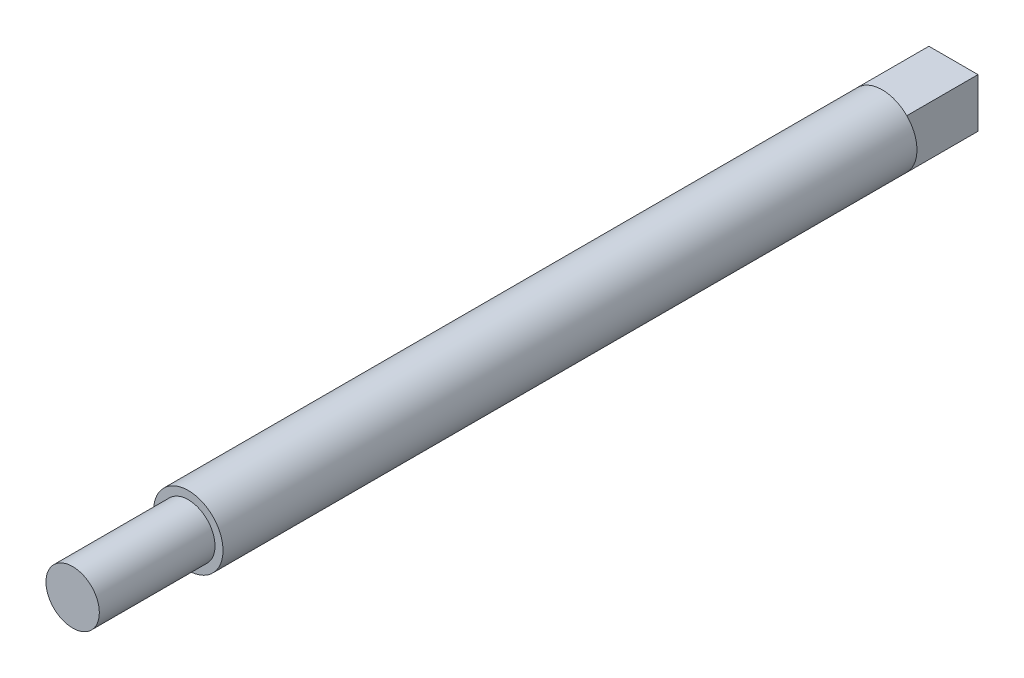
ISO-10303-21;
HEADER;
FILE_DESCRIPTION(('STEP AP214'),'2;1');
FILE_NAME('part.step','',(''),(''),'','','');
FILE_SCHEMA(('AUTOMOTIVE_DESIGN { 1 0 10303 214 1 1 1 1 }'));
ENDSEC;
DATA;
#1=APPLICATION_CONTEXT('core data for automotive mechanical design processes');
#2=APPLICATION_PROTOCOL_DEFINITION('international standard','automotive_design',2000,#1);
#3=PRODUCT_CONTEXT('',#1,'mechanical');
#4=PRODUCT('Part','Part','',(#3));
#5=PRODUCT_RELATED_PRODUCT_CATEGORY('part','',(#4));
#6=PRODUCT_DEFINITION_FORMATION('','',#4);
#7=PRODUCT_DEFINITION_CONTEXT('part definition',#1,'design');
#8=PRODUCT_DEFINITION('design','',#6,#7);
#9=PRODUCT_DEFINITION_SHAPE('','',#8);
#10=(LENGTH_UNIT() NAMED_UNIT(*) SI_UNIT(.MILLI.,.METRE.));
#11=(NAMED_UNIT(*) PLANE_ANGLE_UNIT() SI_UNIT($,.RADIAN.));
#12=(NAMED_UNIT(*) SI_UNIT($,.STERADIAN.) SOLID_ANGLE_UNIT());
#13=UNCERTAINTY_MEASURE_WITH_UNIT(LENGTH_MEASURE(1.E-05),#10,'distance_accuracy_value','');
#14=(GEOMETRIC_REPRESENTATION_CONTEXT(3) GLOBAL_UNCERTAINTY_ASSIGNED_CONTEXT((#13)) GLOBAL_UNIT_ASSIGNED_CONTEXT((#10,
#11,#12)) REPRESENTATION_CONTEXT('',''));
#15=CARTESIAN_POINT('',(0.,0.,0.));
#16=DIRECTION('',(0.,0.,1.));
#17=DIRECTION('',(1.,0.,0.));
#18=AXIS2_PLACEMENT_3D('',#15,#16,#17);
#19=CARTESIAN_POINT('',(0.,0.,0.));
#20=DIRECTION('',(0.,0.,1.));
#21=DIRECTION('',(1.,0.,0.));
#22=AXIS2_PLACEMENT_3D('',#19,#20,#21);
#23=PLANE('',#22);
#24=DIRECTION('',(0.,1.,0.));
#25=VECTOR('',#24,1.);
#26=CARTESIAN_POINT('',(-1.38,1.38,0.));
#27=LINE('',#26,#25);
#28=CARTESIAN_POINT('',(-1.38,-1.3777155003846,0.));
#29=VERTEX_POINT('',#28);
#30=CARTESIAN_POINT('',(-1.38,1.3777155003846,0.));
#31=VERTEX_POINT('',#30);
#32=EDGE_CURVE('E12',#29,#31,#27,.T.);
#33=ORIENTED_EDGE('',*,*,#32,.F.);
#34=CARTESIAN_POINT('',(0.,0.,0.));
#35=DIRECTION('',(0.,0.,1.));
#36=DIRECTION('',(1.,0.,0.));
#37=AXIS2_PLACEMENT_3D('',#34,#35,#36);
#38=CIRCLE('',#37,1.95);
#39=EDGE_CURVE('E370',#31,#29,#38,.T.);
#40=ORIENTED_EDGE('',*,*,#39,.F.);
#41=EDGE_LOOP('',(#33,#40));
#42=FACE_BOUND('',#41,.T.);
#43=ADVANCED_FACE('F40',(#42),#23,.F.);
#44=DIRECTION('',(-1.,0.,0.));
#45=VECTOR('',#44,1.);
#46=CARTESIAN_POINT('',(1.38,-1.38,0.));
#47=LINE('',#46,#45);
#48=CARTESIAN_POINT('',(1.3777155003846,-1.38,0.));
#49=VERTEX_POINT('',#48);
#50=CARTESIAN_POINT('',(-1.3777155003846,-1.38,0.));
#51=VERTEX_POINT('',#50);
#52=EDGE_CURVE('E49',#49,#51,#47,.T.);
#53=ORIENTED_EDGE('',*,*,#52,.F.);
#54=EDGE_CURVE('E158',#51,#49,#38,.T.);
#55=ORIENTED_EDGE('',*,*,#54,.F.);
#56=EDGE_LOOP('',(#53,#55));
#57=FACE_BOUND('',#56,.T.);
#58=ADVANCED_FACE('F176',(#57),#23,.F.);
#59=DIRECTION('',(0.,-1.,0.));
#60=VECTOR('',#59,1.);
#61=CARTESIAN_POINT('',(1.38,1.38,0.));
#62=LINE('',#61,#60);
#63=CARTESIAN_POINT('',(1.38,1.3777155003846,0.));
#64=VERTEX_POINT('',#63);
#65=CARTESIAN_POINT('',(1.38,-1.3777155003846,0.));
#66=VERTEX_POINT('',#65);
#67=EDGE_CURVE('E152',#64,#66,#62,.T.);
#68=ORIENTED_EDGE('',*,*,#67,.F.);
#69=EDGE_CURVE('E58',#66,#64,#38,.T.);
#70=ORIENTED_EDGE('',*,*,#69,.F.);
#71=EDGE_LOOP('',(#68,#70));
#72=FACE_BOUND('',#71,.T.);
#73=ADVANCED_FACE('F173',(#72),#23,.F.);
#74=DIRECTION('',(1.,0.,0.));
#75=VECTOR('',#74,1.);
#76=CARTESIAN_POINT('',(1.38,1.38,0.));
#77=LINE('',#76,#75);
#78=CARTESIAN_POINT('',(-1.3777155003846,1.38,0.));
#79=VERTEX_POINT('',#78);
#80=CARTESIAN_POINT('',(1.3777155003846,1.38,0.));
#81=VERTEX_POINT('',#80);
#82=EDGE_CURVE('E145',#79,#81,#77,.T.);
#83=ORIENTED_EDGE('',*,*,#82,.F.);
#84=EDGE_CURVE('E146',#81,#79,#38,.T.);
#85=ORIENTED_EDGE('',*,*,#84,.F.);
#86=EDGE_LOOP('',(#83,#85));
#87=FACE_BOUND('',#86,.T.);
#88=ADVANCED_FACE('F165',(#87),#23,.F.);
#89=CARTESIAN_POINT('',(0.,0.,45.5));
#90=DIRECTION('',(0.,0.,-1.));
#91=DIRECTION('',(-1.,0.,0.));
#92=AXIS2_PLACEMENT_3D('',#89,#90,#91);
#93=CYLINDRICAL_SURFACE('',#92,1.95);
#94=EDGE_CURVE('E144',#64,#81,#38,.T.);
#95=ORIENTED_EDGE('',*,*,#94,.T.);
#96=ORIENTED_EDGE('',*,*,#84,.T.);
#97=EDGE_CURVE('E156',#79,#31,#38,.T.);
#98=ORIENTED_EDGE('',*,*,#97,.T.);
#99=ORIENTED_EDGE('',*,*,#39,.T.);
#100=EDGE_CURVE('E369',#29,#51,#38,.T.);
#101=ORIENTED_EDGE('',*,*,#100,.T.);
#102=ORIENTED_EDGE('',*,*,#54,.T.);
#103=EDGE_CURVE('E157',#49,#66,#38,.T.);
#104=ORIENTED_EDGE('',*,*,#103,.T.);
#105=ORIENTED_EDGE('',*,*,#69,.T.);
#106=EDGE_LOOP('',(#95,#96,#98,#99,#101,#102,#104,#105));
#107=FACE_BOUND('',#106,.T.);
#108=CARTESIAN_POINT('',(0.,0.,39.));
#109=DIRECTION('',(0.,0.,1.));
#110=DIRECTION('',(1.,0.,0.));
#111=AXIS2_PLACEMENT_3D('',#108,#109,#110);
#112=CIRCLE('',#111,1.95);
#113=CARTESIAN_POINT('',(1.95,0.,39.));
#114=VERTEX_POINT('',#113);
#115=EDGE_CURVE('E44',#114,#114,#112,.T.);
#116=ORIENTED_EDGE('',*,*,#115,.F.);
#117=EDGE_LOOP('',(#116));
#118=FACE_BOUND('',#117,.T.);
#119=ADVANCED_FACE('F42',(#107,#118),#93,.T.);
#120=CARTESIAN_POINT('',(0.,0.,39.));
#121=DIRECTION('',(0.,0.,1.));
#122=DIRECTION('',(1.,0.,0.));
#123=AXIS2_PLACEMENT_3D('',#120,#121,#122);
#124=PLANE('',#123);
#125=CARTESIAN_POINT('',(0.,0.,39.));
#126=DIRECTION('',(0.,0.,1.));
#127=DIRECTION('',(1.,0.,0.));
#128=AXIS2_PLACEMENT_3D('',#125,#126,#127);
#129=CIRCLE('',#128,1.5);
#130=CARTESIAN_POINT('',(1.5,0.,39.));
#131=VERTEX_POINT('',#130);
#132=EDGE_CURVE('E137',#131,#131,#129,.T.);
#133=ORIENTED_EDGE('',*,*,#132,.F.);
#134=EDGE_LOOP('',(#133));
#135=FACE_BOUND('',#134,.T.);
#136=ORIENTED_EDGE('',*,*,#115,.T.);
#137=EDGE_LOOP('',(#136));
#138=FACE_BOUND('',#137,.T.);
#139=ADVANCED_FACE('F162',(#135,#138),#124,.T.);
#140=CARTESIAN_POINT('',(0.,0.,39.));
#141=DIRECTION('',(0.,0.,1.));
#142=DIRECTION('',(1.,0.,0.));
#143=AXIS2_PLACEMENT_3D('',#140,#141,#142);
#144=CYLINDRICAL_SURFACE('',#143,1.5);
#145=CARTESIAN_POINT('',(0.,0.,45.5));
#146=DIRECTION('',(0.,0.,1.));
#147=DIRECTION('',(1.,0.,0.));
#148=AXIS2_PLACEMENT_3D('',#145,#146,#147);
#149=CIRCLE('',#148,1.5);
#150=CARTESIAN_POINT('',(1.5,0.,45.5));
#151=VERTEX_POINT('',#150);
#152=EDGE_CURVE('E134',#151,#151,#149,.T.);
#153=CARTESIAN_POINT('',(1.5,0.,39.));
#154=CARTESIAN_POINT('',(1.5,0.,39.0677083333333));
#155=CARTESIAN_POINT('',(1.5,0.,39.1354166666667));
#156=CARTESIAN_POINT('',(1.5,0.,39.2708333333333));
#157=CARTESIAN_POINT('',(1.5,0.,39.3385416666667));
#158=CARTESIAN_POINT('',(1.5,0.,39.4739583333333));
#159=CARTESIAN_POINT('',(1.5,0.,39.5416666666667));
#160=CARTESIAN_POINT('',(1.5,0.,39.6770833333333));
#161=CARTESIAN_POINT('',(1.5,0.,39.7447916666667));
#162=CARTESIAN_POINT('',(1.5,0.,39.8802083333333));
#163=CARTESIAN_POINT('',(1.5,0.,39.9479166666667));
#164=CARTESIAN_POINT('',(1.5,0.,40.0833333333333));
#165=CARTESIAN_POINT('',(1.5,0.,40.1510416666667));
#166=CARTESIAN_POINT('',(1.5,0.,40.2864583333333));
#167=CARTESIAN_POINT('',(1.5,0.,40.3541666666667));
#168=CARTESIAN_POINT('',(1.5,0.,40.4895833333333));
#169=CARTESIAN_POINT('',(1.5,0.,40.5572916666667));
#170=CARTESIAN_POINT('',(1.5,0.,40.6927083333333));
#171=CARTESIAN_POINT('',(1.5,0.,40.7604166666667));
#172=CARTESIAN_POINT('',(1.5,0.,40.8958333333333));
#173=CARTESIAN_POINT('',(1.5,0.,40.9635416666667));
#174=CARTESIAN_POINT('',(1.5,0.,41.0989583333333));
#175=CARTESIAN_POINT('',(1.5,0.,41.1666666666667));
#176=CARTESIAN_POINT('',(1.5,0.,41.3020833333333));
#177=CARTESIAN_POINT('',(1.5,0.,41.3697916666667));
#178=CARTESIAN_POINT('',(1.5,0.,41.5052083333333));
#179=CARTESIAN_POINT('',(1.5,0.,41.5729166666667));
#180=CARTESIAN_POINT('',(1.5,0.,41.7083333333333));
#181=CARTESIAN_POINT('',(1.5,0.,41.7760416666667));
#182=CARTESIAN_POINT('',(1.5,0.,41.9114583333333));
#183=CARTESIAN_POINT('',(1.5,0.,41.9791666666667));
#184=CARTESIAN_POINT('',(1.5,0.,42.1145833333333));
#185=CARTESIAN_POINT('',(1.5,0.,42.1822916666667));
#186=CARTESIAN_POINT('',(1.5,0.,42.3177083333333));
#187=CARTESIAN_POINT('',(1.5,0.,42.3854166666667));
#188=CARTESIAN_POINT('',(1.5,0.,42.5208333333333));
#189=CARTESIAN_POINT('',(1.5,0.,42.5885416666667));
#190=CARTESIAN_POINT('',(1.5,0.,42.7239583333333));
#191=CARTESIAN_POINT('',(1.5,0.,42.7916666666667));
#192=CARTESIAN_POINT('',(1.5,0.,42.9270833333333));
#193=CARTESIAN_POINT('',(1.5,0.,42.9947916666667));
#194=CARTESIAN_POINT('',(1.5,0.,43.1302083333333));
#195=CARTESIAN_POINT('',(1.5,0.,43.1979166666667));
#196=CARTESIAN_POINT('',(1.5,0.,43.3333333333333));
#197=CARTESIAN_POINT('',(1.5,0.,43.4010416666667));
#198=CARTESIAN_POINT('',(1.5,0.,43.5364583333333));
#199=CARTESIAN_POINT('',(1.5,0.,43.6041666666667));
#200=CARTESIAN_POINT('',(1.5,0.,43.7395833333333));
#201=CARTESIAN_POINT('',(1.5,0.,43.8072916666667));
#202=CARTESIAN_POINT('',(1.5,0.,43.9427083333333));
#203=CARTESIAN_POINT('',(1.5,0.,44.0104166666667));
#204=CARTESIAN_POINT('',(1.5,0.,44.1458333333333));
#205=CARTESIAN_POINT('',(1.5,0.,44.2135416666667));
#206=CARTESIAN_POINT('',(1.5,0.,44.3489583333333));
#207=CARTESIAN_POINT('',(1.5,0.,44.4166666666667));
#208=CARTESIAN_POINT('',(1.5,0.,44.5520833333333));
#209=CARTESIAN_POINT('',(1.5,0.,44.6197916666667));
#210=CARTESIAN_POINT('',(1.5,0.,44.7552083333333));
#211=CARTESIAN_POINT('',(1.5,0.,44.8229166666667));
#212=CARTESIAN_POINT('',(1.5,0.,44.9583333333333));
#213=CARTESIAN_POINT('',(1.5,0.,45.0260416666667));
#214=CARTESIAN_POINT('',(1.5,0.,45.1614583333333));
#215=CARTESIAN_POINT('',(1.5,0.,45.2291666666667));
#216=CARTESIAN_POINT('',(1.5,0.,45.3645833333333));
#217=CARTESIAN_POINT('',(1.5,0.,45.4322916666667));
#218=CARTESIAN_POINT('',(1.5,0.,45.5));
#219=B_SPLINE_CURVE_WITH_KNOTS('',3,(#153,#154,#155,#156,#157,#158,#159,#160,#161,#162,#163,
#164,#165,#166,#167,#168,#169,#170,#171,#172,#173,#174,#175,#176,#177,#178,#179,#180,#181,#182,
#183,#184,#185,#186,#187,#188,#189,#190,#191,#192,#193,#194,#195,#196,#197,#198,#199,#200,#201,
#202,#203,#204,#205,#206,#207,#208,#209,#210,#211,#212,#213,#214,#215,#216,#217,#218),
.UNSPECIFIED.,.F.,.F.,(4,2,2,2,2,2,2,2,2,2,2,2,2,2,2,2,2,2,2,2,2,2,2,2,2,2,2,2,2,2,2,2,4),(0.,
0.203124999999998,0.406249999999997,0.609374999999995,0.812499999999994,1.015625,1.21875,
1.421875,1.62499999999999,1.82812499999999,2.03125,2.234375,2.4375,2.64062499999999,2.84375,
3.046875,3.25,3.45312499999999,3.65624999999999,3.859375,4.0625,4.26562499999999,
4.46874999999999,4.67187499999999,4.875,5.078125,5.28124999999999,5.48437499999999,
5.68749999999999,5.890625,6.09374999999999,6.29687499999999,6.49999999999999),.UNSPECIFIED.);
#220=EDGE_CURVE('BSEAM170',#131,#151,#219,.T.);
#221=ORIENTED_EDGE('',*,*,#132,.T.);
#222=ORIENTED_EDGE('',*,*,#152,.F.);
#223=ORIENTED_EDGE('',*,*,#220,.T.);
#224=ORIENTED_EDGE('',*,*,#220,.F.);
#225=EDGE_LOOP('',(#221,#223,#222,#224));
#226=FACE_BOUND('',#225,.T.);
#227=ADVANCED_FACE('F170',(#226),#144,.T.);
#228=CARTESIAN_POINT('',(0.,0.,45.5));
#229=DIRECTION('',(0.,0.,1.));
#230=DIRECTION('',(1.,0.,0.));
#231=AXIS2_PLACEMENT_3D('',#228,#229,#230);
#232=PLANE('',#231);
#233=ORIENTED_EDGE('',*,*,#152,.T.);
#234=EDGE_LOOP('',(#233));
#235=FACE_BOUND('',#234,.T.);
#236=ADVANCED_FACE('F182',(#235),#232,.T.);
#237=CARTESIAN_POINT('',(0.,0.,0.));
#238=DIRECTION('',(0.,0.,-1.));
#239=DIRECTION('',(-1.,0.,0.));
#240=AXIS2_PLACEMENT_3D('',#237,#238,#239);
#241=PLANE('',#240);
#242=ORIENTED_EDGE('',*,*,#94,.F.);
#243=CARTESIAN_POINT('',(1.38,1.38,0.));
#244=VERTEX_POINT('',#243);
#245=EDGE_CURVE('E350',#244,#64,#62,.T.);
#246=ORIENTED_EDGE('',*,*,#245,.F.);
#247=EDGE_CURVE('E155',#81,#244,#77,.T.);
#248=ORIENTED_EDGE('',*,*,#247,.F.);
#249=EDGE_LOOP('',(#242,#246,#248));
#250=FACE_BOUND('',#249,.T.);
#251=ADVANCED_FACE('F184',(#250),#241,.F.);
#252=ORIENTED_EDGE('',*,*,#97,.F.);
#253=CARTESIAN_POINT('',(-1.38,1.38,0.));
#254=VERTEX_POINT('',#253);
#255=EDGE_CURVE('E154',#254,#79,#77,.T.);
#256=ORIENTED_EDGE('',*,*,#255,.F.);
#257=EDGE_CURVE('E52',#31,#254,#27,.T.);
#258=ORIENTED_EDGE('',*,*,#257,.F.);
#259=EDGE_LOOP('',(#252,#256,#258));
#260=FACE_BOUND('',#259,.T.);
#261=ADVANCED_FACE('F253',(#260),#241,.F.);
#262=ORIENTED_EDGE('',*,*,#100,.F.);
#263=CARTESIAN_POINT('',(-1.38,-1.38,0.));
#264=VERTEX_POINT('',#263);
#265=EDGE_CURVE('E51',#264,#29,#27,.T.);
#266=ORIENTED_EDGE('',*,*,#265,.F.);
#267=EDGE_CURVE('E353',#51,#264,#47,.T.);
#268=ORIENTED_EDGE('',*,*,#267,.F.);
#269=EDGE_LOOP('',(#262,#266,#268));
#270=FACE_BOUND('',#269,.T.);
#271=ADVANCED_FACE('F192',(#270),#241,.F.);
#272=CARTESIAN_POINT('',(-1.38,1.38,-4.));
#273=DIRECTION('',(1.,0.,0.));
#274=DIRECTION('',(0.,1.,0.));
#275=AXIS2_PLACEMENT_3D('',#272,#273,#274);
#276=PLANE('',#275);
#277=ORIENTED_EDGE('',*,*,#265,.T.);
#278=ORIENTED_EDGE('',*,*,#32,.T.);
#279=ORIENTED_EDGE('',*,*,#257,.T.);
#280=DIRECTION('',(0.,0.,1.));
#281=VECTOR('',#280,1.);
#282=CARTESIAN_POINT('',(-1.38,1.38,-4.));
#283=LINE('',#282,#281);
#284=CARTESIAN_POINT('',(-1.38,1.38,-4.));
#285=VERTEX_POINT('',#284);
#286=EDGE_CURVE('E113',#285,#254,#283,.T.);
#287=ORIENTED_EDGE('',*,*,#286,.F.);
#288=DIRECTION('',(0.,1.,0.));
#289=VECTOR('',#288,1.);
#290=CARTESIAN_POINT('',(-1.38,1.38,-4.));
#291=LINE('',#290,#289);
#292=CARTESIAN_POINT('',(-1.38,-1.38,-4.));
#293=VERTEX_POINT('',#292);
#294=EDGE_CURVE('E119',#293,#285,#291,.T.);
#295=ORIENTED_EDGE('',*,*,#294,.F.);
#296=DIRECTION('',(0.,0.,1.));
#297=VECTOR('',#296,1.);
#298=CARTESIAN_POINT('',(-1.38,-1.38,-4.));
#299=LINE('',#298,#297);
#300=EDGE_CURVE('E359',#293,#264,#299,.T.);
#301=ORIENTED_EDGE('',*,*,#300,.T.);
#302=EDGE_LOOP('',(#277,#278,#279,#287,#295,#301));
#303=FACE_BOUND('',#302,.T.);
#304=ADVANCED_FACE('F131',(#303),#276,.F.);
#305=CARTESIAN_POINT('',(1.38,1.38,-4.));
#306=DIRECTION('',(0.,-1.,0.));
#307=DIRECTION('',(0.,0.,-1.));
#308=AXIS2_PLACEMENT_3D('',#305,#306,#307);
#309=PLANE('',#308);
#310=ORIENTED_EDGE('',*,*,#255,.T.);
#311=ORIENTED_EDGE('',*,*,#82,.T.);
#312=ORIENTED_EDGE('',*,*,#247,.T.);
#313=DIRECTION('',(0.,0.,1.));
#314=VECTOR('',#313,1.);
#315=CARTESIAN_POINT('',(1.38,1.38,-4.));
#316=LINE('',#315,#314);
#317=CARTESIAN_POINT('',(1.38,1.38,-4.));
#318=VERTEX_POINT('',#317);
#319=EDGE_CURVE('E115',#318,#244,#316,.T.);
#320=ORIENTED_EDGE('',*,*,#319,.F.);
#321=DIRECTION('',(1.,0.,0.));
#322=VECTOR('',#321,1.);
#323=CARTESIAN_POINT('',(1.38,1.38,-4.));
#324=LINE('',#323,#322);
#325=EDGE_CURVE('E108',#285,#318,#324,.T.);
#326=ORIENTED_EDGE('',*,*,#325,.F.);
#327=ORIENTED_EDGE('',*,*,#286,.T.);
#328=EDGE_LOOP('',(#310,#311,#312,#320,#326,#327));
#329=FACE_BOUND('',#328,.T.);
#330=ADVANCED_FACE('F111',(#329),#309,.F.);
#331=CARTESIAN_POINT('',(1.38,1.38,-4.));
#332=DIRECTION('',(-1.,0.,0.));
#333=DIRECTION('',(0.,-1.,0.));
#334=AXIS2_PLACEMENT_3D('',#331,#332,#333);
#335=PLANE('',#334);
#336=ORIENTED_EDGE('',*,*,#245,.T.);
#337=ORIENTED_EDGE('',*,*,#67,.T.);
#338=CARTESIAN_POINT('',(1.38,-1.38,0.));
#339=VERTEX_POINT('',#338);
#340=EDGE_CURVE('E351',#66,#339,#62,.T.);
#341=ORIENTED_EDGE('',*,*,#340,.T.);
#342=DIRECTION('',(0.,0.,1.));
#343=VECTOR('',#342,1.);
#344=CARTESIAN_POINT('',(1.38,-1.38,-4.));
#345=LINE('',#344,#343);
#346=CARTESIAN_POINT('',(1.38,-1.38,-4.));
#347=VERTEX_POINT('',#346);
#348=EDGE_CURVE('E139',#347,#339,#345,.T.);
#349=ORIENTED_EDGE('',*,*,#348,.F.);
#350=DIRECTION('',(0.,-1.,0.));
#351=VECTOR('',#350,1.);
#352=CARTESIAN_POINT('',(1.38,1.38,-4.));
#353=LINE('',#352,#351);
#354=EDGE_CURVE('E118',#318,#347,#353,.T.);
#355=ORIENTED_EDGE('',*,*,#354,.F.);
#356=ORIENTED_EDGE('',*,*,#319,.T.);
#357=EDGE_LOOP('',(#336,#337,#341,#349,#355,#356));
#358=FACE_BOUND('',#357,.T.);
#359=ADVANCED_FACE('F195',(#358),#335,.F.);
#360=CARTESIAN_POINT('',(1.38,-1.38,-4.));
#361=DIRECTION('',(0.,1.,0.));
#362=DIRECTION('',(0.,0.,1.));
#363=AXIS2_PLACEMENT_3D('',#360,#361,#362);
#364=PLANE('',#363);
#365=EDGE_CURVE('E128',#339,#49,#47,.T.);
#366=ORIENTED_EDGE('',*,*,#365,.T.);
#367=ORIENTED_EDGE('',*,*,#52,.T.);
#368=ORIENTED_EDGE('',*,*,#267,.T.);
#369=ORIENTED_EDGE('',*,*,#300,.F.);
#370=DIRECTION('',(-1.,0.,0.));
#371=VECTOR('',#370,1.);
#372=CARTESIAN_POINT('',(1.38,-1.38,-4.));
#373=LINE('',#372,#371);
#374=EDGE_CURVE('E124',#347,#293,#373,.T.);
#375=ORIENTED_EDGE('',*,*,#374,.F.);
#376=ORIENTED_EDGE('',*,*,#348,.T.);
#377=EDGE_LOOP('',(#366,#367,#368,#369,#375,#376));
#378=FACE_BOUND('',#377,.T.);
#379=ADVANCED_FACE('F198',(#378),#364,.F.);
#380=CARTESIAN_POINT('',(0.,0.,-4.));
#381=DIRECTION('',(0.,0.,-1.));
#382=DIRECTION('',(-1.,0.,0.));
#383=AXIS2_PLACEMENT_3D('',#380,#381,#382);
#384=PLANE('',#383);
#385=ORIENTED_EDGE('',*,*,#294,.T.);
#386=ORIENTED_EDGE('',*,*,#325,.T.);
#387=ORIENTED_EDGE('',*,*,#354,.T.);
#388=ORIENTED_EDGE('',*,*,#374,.T.);
#389=EDGE_LOOP('',(#385,#386,#387,#388));
#390=FACE_BOUND('',#389,.T.);
#391=ADVANCED_FACE('F122',(#390),#384,.T.);
#392=ORIENTED_EDGE('',*,*,#103,.F.);
#393=ORIENTED_EDGE('',*,*,#365,.F.);
#394=ORIENTED_EDGE('',*,*,#340,.F.);
#395=EDGE_LOOP('',(#392,#393,#394));
#396=FACE_BOUND('',#395,.T.);
#397=ADVANCED_FACE('F203',(#396),#241,.F.);
#398=CLOSED_SHELL('',(#43,#58,#73,#88,#119,#139,#227,#236,#251,#261,#271,#304,#330,#359,#379,
#391,#397));
#399=MANIFOLD_SOLID_BREP('B2',#398);
#400=ADVANCED_BREP_SHAPE_REPRESENTATION('',(#18,#399),#14);
#401=SHAPE_DEFINITION_REPRESENTATION(#9,#400);
ENDSEC;
END-ISO-10303-21;
